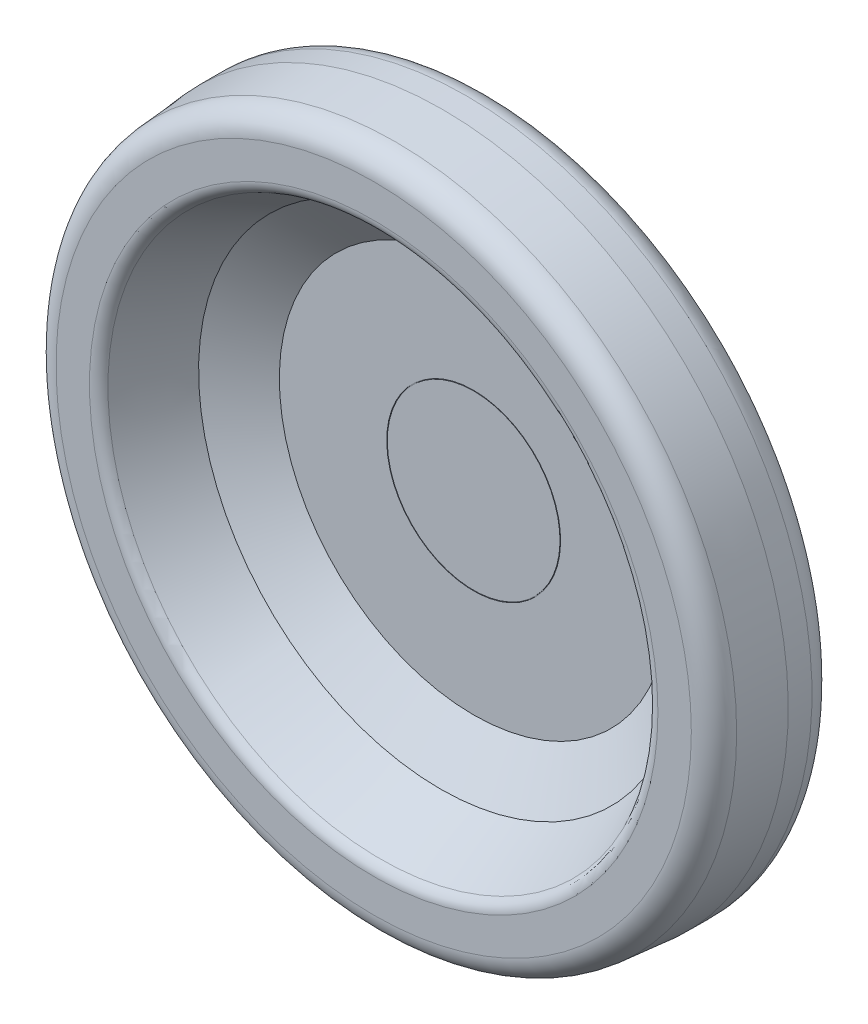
ISO-10303-21;
HEADER;
FILE_DESCRIPTION(('STEP AP214'),'2;1');
FILE_NAME('part.step','',(''),(''),'','','');
FILE_SCHEMA(('AUTOMOTIVE_DESIGN { 1 0 10303 214 1 1 1 1 }'));
ENDSEC;
DATA;
#1=APPLICATION_CONTEXT('core data for automotive mechanical design processes');
#2=APPLICATION_PROTOCOL_DEFINITION('international standard','automotive_design',2000,#1);
#3=PRODUCT_CONTEXT('',#1,'mechanical');
#4=PRODUCT('Part','Part','',(#3));
#5=PRODUCT_RELATED_PRODUCT_CATEGORY('part','',(#4));
#6=PRODUCT_DEFINITION_FORMATION('','',#4);
#7=PRODUCT_DEFINITION_CONTEXT('part definition',#1,'design');
#8=PRODUCT_DEFINITION('design','',#6,#7);
#9=PRODUCT_DEFINITION_SHAPE('','',#8);
#10=(LENGTH_UNIT() NAMED_UNIT(*) SI_UNIT(.MILLI.,.METRE.));
#11=(NAMED_UNIT(*) PLANE_ANGLE_UNIT() SI_UNIT($,.RADIAN.));
#12=(NAMED_UNIT(*) SI_UNIT($,.STERADIAN.) SOLID_ANGLE_UNIT());
#13=UNCERTAINTY_MEASURE_WITH_UNIT(LENGTH_MEASURE(1.E-05),#10,'distance_accuracy_value','');
#14=(GEOMETRIC_REPRESENTATION_CONTEXT(3) GLOBAL_UNCERTAINTY_ASSIGNED_CONTEXT((#13)) GLOBAL_UNIT_ASSIGNED_CONTEXT((#10,
#11,#12)) REPRESENTATION_CONTEXT('',''));
#15=CARTESIAN_POINT('',(0.,0.,0.));
#16=DIRECTION('',(0.,0.,1.));
#17=DIRECTION('',(1.,0.,0.));
#18=AXIS2_PLACEMENT_3D('',#15,#16,#17);
#19=CARTESIAN_POINT('',(10.07,0.,39.));
#20=DIRECTION('',(0.,0.,-1.));
#21=DIRECTION('',(0.,1.,0.));
#22=AXIS2_PLACEMENT_3D('',#19,#20,#21);
#23=PLANE('',#22);
#24=CARTESIAN_POINT('',(0.,0.,39.));
#25=DIRECTION('',(0.,0.,-1.));
#26=DIRECTION('',(0.,1.,0.));
#27=AXIS2_PLACEMENT_3D('',#24,#25,#26);
#28=CIRCLE('',#27,20.14);
#29=CARTESIAN_POINT('',(0.,20.14,39.));
#30=VERTEX_POINT('',#29);
#31=EDGE_CURVE('E391',#30,#30,#28,.T.);
#32=ORIENTED_EDGE('',*,*,#31,.T.);
#33=EDGE_LOOP('',(#32));
#34=FACE_BOUND('',#33,.T.);
#35=ADVANCED_FACE('F14',(#34),#23,.T.);
#36=CARTESIAN_POINT('',(10.,0.,40.85));
#37=DIRECTION('',(0.,0.,1.));
#38=DIRECTION('',(0.,-1.,0.));
#39=AXIS2_PLACEMENT_3D('',#36,#37,#38);
#40=PLANE('',#39);
#41=CARTESIAN_POINT('',(0.,0.,40.85));
#42=DIRECTION('',(0.,0.,-1.));
#43=DIRECTION('',(0.,1.,0.));
#44=AXIS2_PLACEMENT_3D('',#41,#42,#43);
#45=CIRCLE('',#44,20.);
#46=CARTESIAN_POINT('',(0.,20.,40.85));
#47=VERTEX_POINT('',#46);
#48=EDGE_CURVE('E388',#47,#47,#45,.T.);
#49=ORIENTED_EDGE('',*,*,#48,.F.);
#50=EDGE_LOOP('',(#49));
#51=FACE_BOUND('',#50,.T.);
#52=ADVANCED_FACE('F173',(#51),#40,.T.);
#53=CARTESIAN_POINT('',(0.,0.,35.15));
#54=DIRECTION('',(0.,0.,-1.));
#55=DIRECTION('',(0.,1.,0.));
#56=AXIS2_PLACEMENT_3D('',#53,#54,#55);
#57=CYLINDRICAL_SURFACE('',#56,20.14);
#58=CARTESIAN_POINT('',(0.,0.,31.3));
#59=DIRECTION('',(0.,0.,-1.));
#60=DIRECTION('',(0.,1.,0.));
#61=AXIS2_PLACEMENT_3D('',#58,#59,#60);
#62=CIRCLE('',#61,20.14);
#63=CARTESIAN_POINT('',(0.,20.14,31.3));
#64=VERTEX_POINT('',#63);
#65=EDGE_CURVE('E385',#64,#64,#62,.F.);
#66=ORIENTED_EDGE('',*,*,#65,.F.);
#67=EDGE_LOOP('',(#66));
#68=FACE_BOUND('',#67,.T.);
#69=ORIENTED_EDGE('',*,*,#31,.F.);
#70=EDGE_LOOP('',(#69));
#71=FACE_BOUND('',#70,.T.);
#72=ADVANCED_FACE('F169',(#68,#71),#57,.F.);
#73=CARTESIAN_POINT('',(0.,0.,40.723));
#74=DIRECTION('',(0.,0.,-1.));
#75=DIRECTION('',(0.,1.,0.));
#76=AXIS2_PLACEMENT_3D('',#73,#74,#75);
#77=CYLINDRICAL_SURFACE('',#76,20.);
#78=ORIENTED_EDGE('',*,*,#48,.T.);
#79=EDGE_LOOP('',(#78));
#80=FACE_BOUND('',#79,.T.);
#81=CARTESIAN_POINT('',(0.,0.,40.596));
#82=DIRECTION('',(0.,0.,-1.));
#83=DIRECTION('',(0.,1.,0.));
#84=AXIS2_PLACEMENT_3D('',#81,#82,#83);
#85=CIRCLE('',#84,20.);
#86=CARTESIAN_POINT('',(0.,20.,40.596));
#87=VERTEX_POINT('',#86);
#88=EDGE_CURVE('E382',#87,#87,#85,.T.);
#89=ORIENTED_EDGE('',*,*,#88,.F.);
#90=EDGE_LOOP('',(#89));
#91=FACE_BOUND('',#90,.T.);
#92=ADVANCED_FACE('F165',(#80,#91),#77,.T.);
#93=CARTESIAN_POINT('',(19.57,0.,31.3));
#94=DIRECTION('',(0.,0.,1.));
#95=DIRECTION('',(0.,-1.,0.));
#96=AXIS2_PLACEMENT_3D('',#93,#94,#95);
#97=PLANE('',#96);
#98=ORIENTED_EDGE('',*,*,#65,.T.);
#99=EDGE_LOOP('',(#98));
#100=FACE_BOUND('',#99,.T.);
#101=CARTESIAN_POINT('',(0.,0.,31.3));
#102=DIRECTION('',(0.,0.,-1.));
#103=DIRECTION('',(0.,1.,0.));
#104=AXIS2_PLACEMENT_3D('',#101,#102,#103);
#105=CIRCLE('',#104,19.);
#106=CARTESIAN_POINT('',(0.,19.,31.3));
#107=VERTEX_POINT('',#106);
#108=EDGE_CURVE('E379',#107,#107,#105,.T.);
#109=ORIENTED_EDGE('',*,*,#108,.T.);
#110=EDGE_LOOP('',(#109));
#111=FACE_BOUND('',#110,.T.);
#112=ADVANCED_FACE('F161',(#100,#111),#97,.T.);
#113=CARTESIAN_POINT('',(20.0635,0.,40.596));
#114=DIRECTION('',(0.,0.,1.));
#115=DIRECTION('',(0.,-1.,0.));
#116=AXIS2_PLACEMENT_3D('',#113,#114,#115);
#117=PLANE('',#116);
#118=CARTESIAN_POINT('',(0.,0.,40.596));
#119=DIRECTION('',(0.,0.,-1.));
#120=DIRECTION('',(0.,1.,0.));
#121=AXIS2_PLACEMENT_3D('',#118,#119,#120);
#122=CIRCLE('',#121,20.127);
#123=CARTESIAN_POINT('',(0.,20.127,40.596));
#124=VERTEX_POINT('',#123);
#125=EDGE_CURVE('E376',#124,#124,#122,.F.);
#126=ORIENTED_EDGE('',*,*,#125,.T.);
#127=EDGE_LOOP('',(#126));
#128=FACE_BOUND('',#127,.T.);
#129=ORIENTED_EDGE('',*,*,#88,.T.);
#130=EDGE_LOOP('',(#129));
#131=FACE_BOUND('',#130,.T.);
#132=ADVANCED_FACE('F157',(#128,#131),#117,.T.);
#133=CARTESIAN_POINT('',(0.,0.,29.65));
#134=DIRECTION('',(0.,0.,-1.));
#135=DIRECTION('',(0.,1.,0.));
#136=AXIS2_PLACEMENT_3D('',#133,#134,#135);
#137=CYLINDRICAL_SURFACE('',#136,19.);
#138=CARTESIAN_POINT('',(0.,0.,28.));
#139=DIRECTION('',(0.,0.,-1.));
#140=DIRECTION('',(0.,1.,0.));
#141=AXIS2_PLACEMENT_3D('',#138,#139,#140);
#142=CIRCLE('',#141,19.);
#143=CARTESIAN_POINT('',(0.,19.,28.));
#144=VERTEX_POINT('',#143);
#145=EDGE_CURVE('E373',#144,#144,#142,.F.);
#146=ORIENTED_EDGE('',*,*,#145,.F.);
#147=EDGE_LOOP('',(#146));
#148=FACE_BOUND('',#147,.T.);
#149=ORIENTED_EDGE('',*,*,#108,.F.);
#150=EDGE_LOOP('',(#149));
#151=FACE_BOUND('',#150,.T.);
#152=ADVANCED_FACE('F153',(#148,#151),#137,.F.);
#153=CARTESIAN_POINT('',(0.,0.,40.723));
#154=DIRECTION('',(0.,0.,-1.));
#155=DIRECTION('',(0.,1.,0.));
#156=AXIS2_PLACEMENT_3D('',#153,#154,#155);
#157=CYLINDRICAL_SURFACE('',#156,20.127);
#158=ORIENTED_EDGE('',*,*,#125,.F.);
#159=EDGE_LOOP('',(#158));
#160=FACE_BOUND('',#159,.T.);
#161=CARTESIAN_POINT('',(0.,0.,40.85));
#162=DIRECTION('',(0.,0.,-1.));
#163=DIRECTION('',(0.,1.,0.));
#164=AXIS2_PLACEMENT_3D('',#161,#162,#163);
#165=CIRCLE('',#164,20.127);
#166=CARTESIAN_POINT('',(0.,20.127,40.85));
#167=VERTEX_POINT('',#166);
#168=EDGE_CURVE('E370',#167,#167,#165,.T.);
#169=ORIENTED_EDGE('',*,*,#168,.F.);
#170=EDGE_LOOP('',(#169));
#171=FACE_BOUND('',#170,.T.);
#172=ADVANCED_FACE('F149',(#160,#171),#157,.F.);
#173=CARTESIAN_POINT('',(13.,0.,28.));
#174=DIRECTION('',(0.,0.,1.));
#175=DIRECTION('',(0.,-1.,0.));
#176=AXIS2_PLACEMENT_3D('',#173,#174,#175);
#177=PLANE('',#176);
#178=ORIENTED_EDGE('',*,*,#145,.T.);
#179=EDGE_LOOP('',(#178));
#180=FACE_BOUND('',#179,.T.);
#181=CARTESIAN_POINT('',(0.,0.,28.));
#182=DIRECTION('',(0.,0.,-1.));
#183=DIRECTION('',(0.,1.,0.));
#184=AXIS2_PLACEMENT_3D('',#181,#182,#183);
#185=CIRCLE('',#184,7.);
#186=CARTESIAN_POINT('',(0.,7.,28.));
#187=VERTEX_POINT('',#186);
#188=EDGE_CURVE('E367',#187,#187,#185,.T.);
#189=ORIENTED_EDGE('',*,*,#188,.T.);
#190=EDGE_LOOP('',(#189));
#191=FACE_BOUND('',#190,.T.);
#192=ADVANCED_FACE('F145',(#180,#191),#177,.T.);
#193=CARTESIAN_POINT('',(32.5635,0.,40.85));
#194=DIRECTION('',(0.,0.,1.));
#195=DIRECTION('',(0.,-1.,0.));
#196=AXIS2_PLACEMENT_3D('',#193,#194,#195);
#197=PLANE('',#196);
#198=CARTESIAN_POINT('',(0.,0.,40.85));
#199=DIRECTION('',(0.,0.,1.));
#200=DIRECTION('',(0.,-1.,0.));
#201=AXIS2_PLACEMENT_3D('',#198,#199,#200);
#202=CIRCLE('',#201,45.);
#203=CARTESIAN_POINT('',(0.,-45.,40.85));
#204=VERTEX_POINT('',#203);
#205=EDGE_CURVE('E364',#204,#204,#202,.T.);
#206=ORIENTED_EDGE('',*,*,#205,.T.);
#207=EDGE_LOOP('',(#206));
#208=FACE_BOUND('',#207,.T.);
#209=ORIENTED_EDGE('',*,*,#168,.T.);
#210=EDGE_LOOP('',(#209));
#211=FACE_BOUND('',#210,.T.);
#212=ADVANCED_FACE('F141',(#208,#211),#197,.T.);
#213=CARTESIAN_POINT('',(0.,0.,14.));
#214=DIRECTION('',(0.,0.,-1.));
#215=DIRECTION('',(0.,1.,0.));
#216=AXIS2_PLACEMENT_3D('',#213,#214,#215);
#217=CYLINDRICAL_SURFACE('',#216,7.);
#218=CARTESIAN_POINT('',(0.,0.,0.));
#219=DIRECTION('',(0.,0.,-1.));
#220=DIRECTION('',(0.,1.,0.));
#221=AXIS2_PLACEMENT_3D('',#218,#219,#220);
#222=CIRCLE('',#221,7.);
#223=CARTESIAN_POINT('',(0.,7.,0.));
#224=VERTEX_POINT('',#223);
#225=EDGE_CURVE('E361',#224,#224,#222,.F.);
#226=ORIENTED_EDGE('',*,*,#225,.F.);
#227=EDGE_LOOP('',(#226));
#228=FACE_BOUND('',#227,.T.);
#229=ORIENTED_EDGE('',*,*,#188,.F.);
#230=EDGE_LOOP('',(#229));
#231=FACE_BOUND('',#230,.T.);
#232=ADVANCED_FACE('F137',(#228,#231),#217,.F.);
#233=CARTESIAN_POINT('',(0.,0.,48.5522829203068));
#234=DIRECTION('',(0.,0.,1.));
#235=DIRECTION('',(0.,-1.,0.));
#236=AXIS2_PLACEMENT_3D('',#233,#234,#235);
#237=CONICAL_SURFACE('',#236,56.,0.959931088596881);
#238=ORIENTED_EDGE('',*,*,#205,.F.);
#239=EDGE_LOOP('',(#238));
#240=FACE_BOUND('',#239,.T.);
#241=CARTESIAN_POINT('',(0.,0.,48.5522829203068));
#242=DIRECTION('',(0.,0.,1.));
#243=DIRECTION('',(1.,0.,0.));
#244=AXIS2_PLACEMENT_3D('',#241,#242,#243);
#245=CIRCLE('',#244,56.);
#246=CARTESIAN_POINT('',(56.,0.,48.5522829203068));
#247=VERTEX_POINT('',#246);
#248=EDGE_CURVE('E355',#247,#247,#245,.T.);
#249=ORIENTED_EDGE('',*,*,#248,.T.);
#250=EDGE_LOOP('',(#249));
#251=FACE_BOUND('',#250,.T.);
#252=ADVANCED_FACE('F133',(#240,#251),#237,.F.);
#253=CARTESIAN_POINT('',(12.25,0.,0.));
#254=DIRECTION('',(0.,0.,-1.));
#255=DIRECTION('',(0.,1.,0.));
#256=AXIS2_PLACEMENT_3D('',#253,#254,#255);
#257=PLANE('',#256);
#258=ORIENTED_EDGE('',*,*,#225,.T.);
#259=EDGE_LOOP('',(#258));
#260=FACE_BOUND('',#259,.T.);
#261=CARTESIAN_POINT('',(0.,0.,0.));
#262=DIRECTION('',(0.,0.,-1.));
#263=DIRECTION('',(0.,1.,0.));
#264=AXIS2_PLACEMENT_3D('',#261,#262,#263);
#265=CIRCLE('',#264,17.5);
#266=CARTESIAN_POINT('',(0.,17.5,0.));
#267=VERTEX_POINT('',#266);
#268=EDGE_CURVE('E358',#267,#267,#265,.F.);
#269=ORIENTED_EDGE('',*,*,#268,.F.);
#270=EDGE_LOOP('',(#269));
#271=FACE_BOUND('',#270,.T.);
#272=ADVANCED_FACE('F129',(#260,#271),#257,.T.);
#273=CARTESIAN_POINT('',(0.,0.,64.));
#274=DIRECTION('',(0.,0.,1.));
#275=DIRECTION('',(0.,-1.,0.));
#276=AXIS2_PLACEMENT_3D('',#273,#274,#275);
#277=CONICAL_SURFACE('',#276,64.,0.477845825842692);
#278=CARTESIAN_POINT('',(0.,0.,62.3796020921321));
#279=DIRECTION('',(0.,0.,1.));
#280=DIRECTION('',(1.,0.,0.));
#281=AXIS2_PLACEMENT_3D('',#278,#279,#280);
#282=CIRCLE('',#281,63.1608350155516);
#283=CARTESIAN_POINT('',(63.1608350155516,0.,62.3796020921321));
#284=VERTEX_POINT('',#283);
#285=EDGE_CURVE('E9',#284,#284,#282,.T.);
#286=ORIENTED_EDGE('',*,*,#285,.T.);
#287=EDGE_LOOP('',(#286));
#288=FACE_BOUND('',#287,.T.);
#289=ORIENTED_EDGE('',*,*,#248,.F.);
#290=EDGE_LOOP('',(#289));
#291=FACE_BOUND('',#290,.T.);
#292=ADVANCED_FACE('F125',(#288,#291),#277,.F.);
#293=CARTESIAN_POINT('',(0.,0.,0.127000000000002));
#294=DIRECTION('',(0.,0.,-1.));
#295=DIRECTION('',(0.,1.,0.));
#296=AXIS2_PLACEMENT_3D('',#293,#294,#295);
#297=CYLINDRICAL_SURFACE('',#296,17.5);
#298=CARTESIAN_POINT('',(0.,0.,0.254));
#299=DIRECTION('',(0.,0.,-1.));
#300=DIRECTION('',(0.,1.,0.));
#301=AXIS2_PLACEMENT_3D('',#298,#299,#300);
#302=CIRCLE('',#301,17.5);
#303=CARTESIAN_POINT('',(0.,17.5,0.254));
#304=VERTEX_POINT('',#303);
#305=EDGE_CURVE('E63',#304,#304,#302,.F.);
#306=ORIENTED_EDGE('',*,*,#305,.F.);
#307=EDGE_LOOP('',(#306));
#308=FACE_BOUND('',#307,.T.);
#309=ORIENTED_EDGE('',*,*,#268,.T.);
#310=EDGE_LOOP('',(#309));
#311=FACE_BOUND('',#310,.T.);
#312=ADVANCED_FACE('F112',(#308,#311),#297,.T.);
#313=CARTESIAN_POINT('',(68.7801799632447,0.,64.));
#314=DIRECTION('',(0.,0.,1.));
#315=DIRECTION('',(0.,-1.,0.));
#316=AXIS2_PLACEMENT_3D('',#313,#314,#315);
#317=PLANE('',#316);
#318=CARTESIAN_POINT('',(0.,0.,64.));
#319=DIRECTION('',(0.,0.,1.));
#320=DIRECTION('',(1.,0.,0.));
#321=AXIS2_PLACEMENT_3D('',#318,#319,#320);
#322=CIRCLE('',#321,65.8247978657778);
#323=CARTESIAN_POINT('',(65.8247978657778,0.,64.));
#324=VERTEX_POINT('',#323);
#325=EDGE_CURVE('E23',#324,#324,#322,.F.);
#326=ORIENTED_EDGE('',*,*,#325,.T.);
#327=EDGE_LOOP('',(#326));
#328=FACE_BOUND('',#327,.T.);
#329=CARTESIAN_POINT('',(0.,0.,64.));
#330=DIRECTION('',(0.,0.,-1.));
#331=DIRECTION('',(0.,-1.,0.));
#332=AXIS2_PLACEMENT_3D('',#329,#330,#331);
#333=CIRCLE('',#332,73.5603599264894);
#334=CARTESIAN_POINT('',(0.,-73.5603599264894,64.));
#335=VERTEX_POINT('',#334);
#336=CARTESIAN_POINT('',(0.,73.5603599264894,64.));
#337=VERTEX_POINT('',#336);
#338=EDGE_CURVE('E53',#335,#337,#333,.T.);
#339=ORIENTED_EDGE('',*,*,#338,.F.);
#340=CARTESIAN_POINT('',(0.,0.,64.));
#341=DIRECTION('',(0.,0.,-1.));
#342=DIRECTION('',(1.,0.,0.));
#343=AXIS2_PLACEMENT_3D('',#340,#341,#342);
#344=CIRCLE('',#343,73.5603599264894);
#345=CARTESIAN_POINT('',(73.5603599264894,0.,64.));
#346=VERTEX_POINT('',#345);
#347=EDGE_CURVE('E59',#346,#335,#344,.T.);
#348=ORIENTED_EDGE('',*,*,#347,.F.);
#349=CARTESIAN_POINT('',(0.,0.,64.));
#350=DIRECTION('',(0.,0.,-1.));
#351=DIRECTION('',(0.,1.,0.));
#352=AXIS2_PLACEMENT_3D('',#349,#350,#351);
#353=CIRCLE('',#352,73.5603599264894);
#354=EDGE_CURVE('E61',#337,#346,#353,.T.);
#355=ORIENTED_EDGE('',*,*,#354,.F.);
#356=EDGE_LOOP('',(#339,#348,#355));
#357=FACE_BOUND('',#356,.T.);
#358=ADVANCED_FACE('F58',(#328,#357),#317,.T.);
#359=CARTESIAN_POINT('',(20.25,0.,0.254));
#360=DIRECTION('',(0.,0.,-1.));
#361=DIRECTION('',(1.,0.,0.));
#362=AXIS2_PLACEMENT_3D('',#359,#360,#361);
#363=PLANE('',#362);
#364=ORIENTED_EDGE('',*,*,#305,.T.);
#365=EDGE_LOOP('',(#364));
#366=FACE_BOUND('',#365,.T.);
#367=CARTESIAN_POINT('',(0.,0.,0.254));
#368=DIRECTION('',(0.,0.,-1.));
#369=DIRECTION('',(0.,1.,0.));
#370=AXIS2_PLACEMENT_3D('',#367,#368,#369);
#371=CIRCLE('',#370,23.);
#372=CARTESIAN_POINT('',(0.,23.,0.254));
#373=VERTEX_POINT('',#372);
#374=EDGE_CURVE('E69',#373,#373,#371,.F.);
#375=ORIENTED_EDGE('',*,*,#374,.F.);
#376=EDGE_LOOP('',(#375));
#377=FACE_BOUND('',#376,.T.);
#378=ADVANCED_FACE('F90',(#366,#377),#363,.T.);
#379=CARTESIAN_POINT('',(0.,0.,58.5));
#380=DIRECTION('',(0.,0.,1.));
#381=DIRECTION('',(0.,-1.,0.));
#382=AXIS2_PLACEMENT_3D('',#379,#380,#381);
#383=TOROIDAL_SURFACE('',#382,73.5603599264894,5.5);
#384=CARTESIAN_POINT('',(0.,0.,58.9793565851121));
#385=DIRECTION('',(0.,0.,-1.));
#386=DIRECTION('',(1.,0.,0.));
#387=AXIS2_PLACEMENT_3D('',#384,#385,#386);
#388=CIRCLE('',#387,79.039430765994);
#389=CARTESIAN_POINT('',(79.039430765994,0.,58.9793565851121));
#390=VERTEX_POINT('',#389);
#391=EDGE_CURVE('E100',#390,#390,#388,.T.);
#392=ORIENTED_EDGE('',*,*,#391,.F.);
#393=EDGE_LOOP('',(#392));
#394=FACE_BOUND('',#393,.T.);
#395=ORIENTED_EDGE('',*,*,#354,.T.);
#396=ORIENTED_EDGE('',*,*,#347,.T.);
#397=ORIENTED_EDGE('',*,*,#338,.T.);
#398=EDGE_LOOP('',(#395,#396,#397));
#399=FACE_BOUND('',#398,.T.);
#400=ADVANCED_FACE('F67',(#394,#399),#383,.T.);
#401=CARTESIAN_POINT('',(0.,0.,10.165159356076));
#402=DIRECTION('',(0.,0.,-1.));
#403=DIRECTION('',(0.,1.,0.));
#404=AXIS2_PLACEMENT_3D('',#401,#402,#403);
#405=CYLINDRICAL_SURFACE('',#404,23.);
#406=CARTESIAN_POINT('',(0.,0.,20.076318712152));
#407=DIRECTION('',(0.,0.,1.));
#408=DIRECTION('',(0.,-1.,0.));
#409=AXIS2_PLACEMENT_3D('',#406,#407,#408);
#410=CIRCLE('',#409,23.);
#411=CARTESIAN_POINT('',(0.,-23.,20.076318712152));
#412=VERTEX_POINT('',#411);
#413=EDGE_CURVE('E98',#412,#412,#410,.F.);
#414=ORIENTED_EDGE('',*,*,#413,.T.);
#415=EDGE_LOOP('',(#414));
#416=FACE_BOUND('',#415,.T.);
#417=ORIENTED_EDGE('',*,*,#374,.T.);
#418=EDGE_LOOP('',(#417));
#419=FACE_BOUND('',#418,.T.);
#420=ADVANCED_FACE('F89',(#416,#419),#405,.T.);
#421=CARTESIAN_POINT('',(0.,0.,48.));
#422=DIRECTION('',(0.,0.,-1.));
#423=DIRECTION('',(0.,1.,0.));
#424=AXIS2_PLACEMENT_3D('',#421,#422,#423);
#425=CONICAL_SURFACE('',#424,80.,0.0872664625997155);
#426=CARTESIAN_POINT('',(0.,0.,48.));
#427=DIRECTION('',(0.,0.,-1.));
#428=DIRECTION('',(0.,1.,0.));
#429=AXIS2_PLACEMENT_3D('',#426,#427,#428);
#430=CIRCLE('',#429,80.);
#431=CARTESIAN_POINT('',(0.,80.,48.));
#432=VERTEX_POINT('',#431);
#433=EDGE_CURVE('E341',#432,#432,#430,.T.);
#434=ORIENTED_EDGE('',*,*,#433,.F.);
#435=EDGE_LOOP('',(#434));
#436=FACE_BOUND('',#435,.T.);
#437=ORIENTED_EDGE('',*,*,#391,.T.);
#438=EDGE_LOOP('',(#437));
#439=FACE_BOUND('',#438,.T.);
#440=ADVANCED_FACE('F329',(#436,#439),#425,.T.);
#441=CARTESIAN_POINT('',(0.,0.,20.0763187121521));
#442=DIRECTION('',(0.,0.,1.));
#443=DIRECTION('',(0.,-1.,0.));
#444=AXIS2_PLACEMENT_3D('',#441,#442,#443);
#445=TOROIDAL_SURFACE('',#444,28.5,5.5);
#446=CARTESIAN_POINT('',(0.,0.,25.1829405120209));
#447=DIRECTION('',(0.,0.,1.));
#448=DIRECTION('',(1.,0.,0.));
#449=AXIS2_PLACEMENT_3D('',#446,#447,#448);
#450=CIRCLE('',#449,26.4573512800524);
#451=CARTESIAN_POINT('',(26.4573512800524,0.,25.1829405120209));
#452=VERTEX_POINT('',#451);
#453=EDGE_CURVE('E320',#452,#452,#450,.T.);
#454=ORIENTED_EDGE('',*,*,#453,.F.);
#455=EDGE_LOOP('',(#454));
#456=FACE_BOUND('',#455,.T.);
#457=ORIENTED_EDGE('',*,*,#413,.F.);
#458=EDGE_LOOP('',(#457));
#459=FACE_BOUND('',#458,.T.);
#460=ADVANCED_FACE('F326',(#456,#459),#445,.F.);
#461=CARTESIAN_POINT('',(0.,0.,45.25));
#462=DIRECTION('',(0.,0.,-1.));
#463=DIRECTION('',(0.,1.,0.));
#464=AXIS2_PLACEMENT_3D('',#461,#462,#463);
#465=CYLINDRICAL_SURFACE('',#464,80.);
#466=CARTESIAN_POINT('',(0.,0.,42.5));
#467=DIRECTION('',(0.,0.,1.));
#468=DIRECTION('',(0.,-1.,0.));
#469=AXIS2_PLACEMENT_3D('',#466,#467,#468);
#470=CIRCLE('',#469,80.);
#471=CARTESIAN_POINT('',(0.,-80.,42.5));
#472=VERTEX_POINT('',#471);
#473=EDGE_CURVE('E316',#472,#472,#470,.F.);
#474=ORIENTED_EDGE('',*,*,#473,.F.);
#475=EDGE_LOOP('',(#474));
#476=FACE_BOUND('',#475,.T.);
#477=ORIENTED_EDGE('',*,*,#433,.T.);
#478=EDGE_LOOP('',(#477));
#479=FACE_BOUND('',#478,.T.);
#480=ADVANCED_FACE('F328',(#476,#479),#465,.T.);
#481=CARTESIAN_POINT('',(0.,0.,36.6066217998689));
#482=DIRECTION('',(0.,0.,1.));
#483=DIRECTION('',(0.,-1.,0.));
#484=AXIS2_PLACEMENT_3D('',#481,#482,#483);
#485=CONICAL_SURFACE('',#484,55.0165544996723,1.19028994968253);
#486=CARTESIAN_POINT('',(0.,0.,36.6066217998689));
#487=DIRECTION('',(0.,0.,1.));
#488=DIRECTION('',(0.,-1.,0.));
#489=AXIS2_PLACEMENT_3D('',#486,#487,#488);
#490=CIRCLE('',#489,55.0165544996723);
#491=CARTESIAN_POINT('',(0.,-55.0165544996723,36.6066217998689));
#492=VERTEX_POINT('',#491);
#493=EDGE_CURVE('E314',#492,#492,#490,.F.);
#494=ORIENTED_EDGE('',*,*,#493,.T.);
#495=EDGE_LOOP('',(#494));
#496=FACE_BOUND('',#495,.T.);
#497=ORIENTED_EDGE('',*,*,#453,.T.);
#498=EDGE_LOOP('',(#497));
#499=FACE_BOUND('',#498,.T.);
#500=ADVANCED_FACE('F268',(#496,#499),#485,.T.);
#501=CARTESIAN_POINT('',(0.,0.,42.5));
#502=DIRECTION('',(0.,0.,1.));
#503=DIRECTION('',(0.,-1.,0.));
#504=AXIS2_PLACEMENT_3D('',#501,#502,#503);
#505=TOROIDAL_SURFACE('',#504,74.5,5.5);
#506=ORIENTED_EDGE('',*,*,#473,.T.);
#507=EDGE_LOOP('',(#506));
#508=FACE_BOUND('',#507,.T.);
#509=CARTESIAN_POINT('',(0.,0.,37.));
#510=DIRECTION('',(0.,0.,1.));
#511=DIRECTION('',(0.,1.,0.));
#512=AXIS2_PLACEMENT_3D('',#509,#510,#511);
#513=CIRCLE('',#512,74.5);
#514=CARTESIAN_POINT('',(0.,-74.5,37.));
#515=VERTEX_POINT('',#514);
#516=CARTESIAN_POINT('',(0.,74.5,37.));
#517=VERTEX_POINT('',#516);
#518=EDGE_CURVE('E311',#515,#517,#513,.F.);
#519=ORIENTED_EDGE('',*,*,#518,.F.);
#520=CARTESIAN_POINT('',(0.,0.,37.));
#521=DIRECTION('',(0.,0.,1.));
#522=DIRECTION('',(0.,-1.,0.));
#523=AXIS2_PLACEMENT_3D('',#520,#521,#522);
#524=CIRCLE('',#523,74.5);
#525=CARTESIAN_POINT('',(74.5,0.,37.));
#526=VERTEX_POINT('',#525);
#527=EDGE_CURVE('E312',#526,#515,#524,.F.);
#528=ORIENTED_EDGE('',*,*,#527,.F.);
#529=CARTESIAN_POINT('',(0.,0.,37.));
#530=DIRECTION('',(0.,0.,1.));
#531=DIRECTION('',(1.,0.,0.));
#532=AXIS2_PLACEMENT_3D('',#529,#530,#531);
#533=CIRCLE('',#532,74.5);
#534=EDGE_CURVE('E291',#517,#526,#533,.F.);
#535=ORIENTED_EDGE('',*,*,#534,.F.);
#536=EDGE_LOOP('',(#519,#528,#535));
#537=FACE_BOUND('',#536,.T.);
#538=ADVANCED_FACE('F195',(#508,#537),#505,.T.);
#539=CARTESIAN_POINT('',(0.,0.,31.5));
#540=DIRECTION('',(0.,0.,1.));
#541=DIRECTION('',(0.,-1.,0.));
#542=AXIS2_PLACEMENT_3D('',#539,#540,#541);
#543=TOROIDAL_SURFACE('',#542,57.0592032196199,5.49999999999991);
#544=CARTESIAN_POINT('',(0.,0.,36.9999999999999));
#545=DIRECTION('',(0.,0.,-1.));
#546=DIRECTION('',(1.,0.,0.));
#547=AXIS2_PLACEMENT_3D('',#544,#545,#546);
#548=CIRCLE('',#547,57.0592032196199);
#549=CARTESIAN_POINT('',(0.,-57.0592032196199,37.));
#550=VERTEX_POINT('',#549);
#551=CARTESIAN_POINT('',(57.0592032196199,0.,37.));
#552=VERTEX_POINT('',#551);
#553=EDGE_CURVE('E31',#550,#552,#548,.F.);
#554=ORIENTED_EDGE('',*,*,#553,.F.);
#555=CARTESIAN_POINT('',(0.,0.,36.9999999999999));
#556=DIRECTION('',(0.,0.,-1.));
#557=DIRECTION('',(0.,-1.,0.));
#558=AXIS2_PLACEMENT_3D('',#555,#556,#557);
#559=CIRCLE('',#558,57.0592032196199);
#560=CARTESIAN_POINT('',(0.,57.0592032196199,37.));
#561=VERTEX_POINT('',#560);
#562=EDGE_CURVE('E310',#561,#550,#559,.F.);
#563=ORIENTED_EDGE('',*,*,#562,.F.);
#564=CARTESIAN_POINT('',(0.,0.,36.9999999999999));
#565=DIRECTION('',(0.,0.,-1.));
#566=DIRECTION('',(0.,1.,0.));
#567=AXIS2_PLACEMENT_3D('',#564,#565,#566);
#568=CIRCLE('',#567,57.0592032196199);
#569=EDGE_CURVE('E253',#552,#561,#568,.F.);
#570=ORIENTED_EDGE('',*,*,#569,.F.);
#571=EDGE_LOOP('',(#554,#563,#570));
#572=FACE_BOUND('',#571,.T.);
#573=ORIENTED_EDGE('',*,*,#493,.F.);
#574=EDGE_LOOP('',(#573));
#575=FACE_BOUND('',#574,.T.);
#576=ADVANCED_FACE('F188',(#572,#575),#543,.F.);
#577=CARTESIAN_POINT('',(65.7796016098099,0.,37.));
#578=DIRECTION('',(0.,0.,-1.));
#579=DIRECTION('',(1.,0.,0.));
#580=AXIS2_PLACEMENT_3D('',#577,#578,#579);
#581=PLANE('',#580);
#582=ORIENTED_EDGE('',*,*,#562,.T.);
#583=ORIENTED_EDGE('',*,*,#553,.T.);
#584=ORIENTED_EDGE('',*,*,#569,.T.);
#585=EDGE_LOOP('',(#582,#583,#584));
#586=FACE_BOUND('',#585,.T.);
#587=ORIENTED_EDGE('',*,*,#527,.T.);
#588=ORIENTED_EDGE('',*,*,#518,.T.);
#589=ORIENTED_EDGE('',*,*,#534,.T.);
#590=EDGE_LOOP('',(#587,#588,#589));
#591=FACE_BOUND('',#590,.T.);
#592=ADVANCED_FACE('F185',(#586,#591),#581,.T.);
#593=CARTESIAN_POINT('',(0.,0.,61.));
#594=DIRECTION('',(0.,0.,1.));
#595=DIRECTION('',(1.,0.,0.));
#596=AXIS2_PLACEMENT_3D('',#593,#594,#595);
#597=TOROIDAL_SURFACE('',#596,65.8247978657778,3.);
#598=ORIENTED_EDGE('',*,*,#285,.F.);
#599=EDGE_LOOP('',(#598));
#600=FACE_BOUND('',#599,.T.);
#601=ORIENTED_EDGE('',*,*,#325,.F.);
#602=EDGE_LOOP('',(#601));
#603=FACE_BOUND('',#602,.T.);
#604=ADVANCED_FACE('F16',(#600,#603),#597,.T.);
#605=CLOSED_SHELL('',(#35,#52,#72,#92,#112,#132,#152,#172,#192,#212,#232,#252,#272,#292,#312,
#358,#378,#400,#420,#440,#460,#480,#500,#538,#576,#592,#604));
#606=MANIFOLD_SOLID_BREP('B1',#605);
#607=ADVANCED_BREP_SHAPE_REPRESENTATION('',(#18,#606),#14);
#608=SHAPE_DEFINITION_REPRESENTATION(#9,#607);
ENDSEC;
END-ISO-10303-21;
